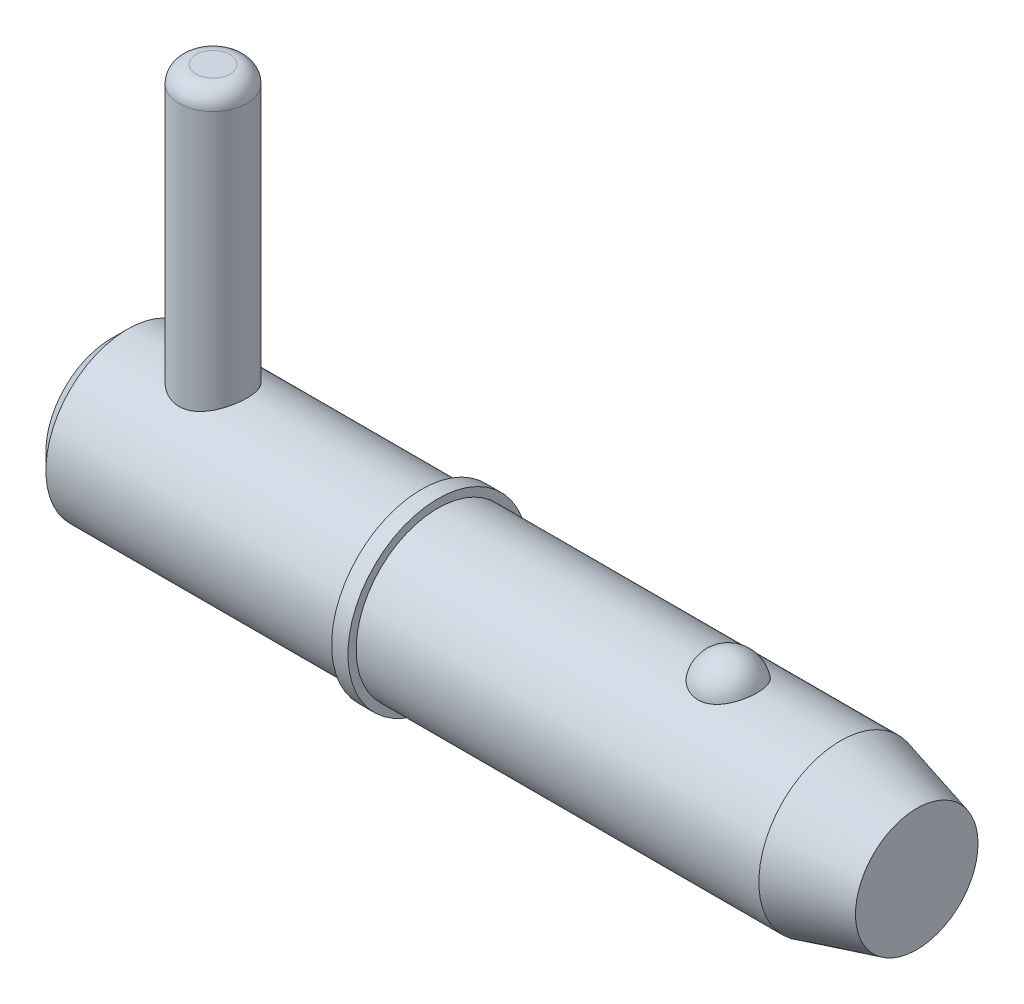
ISO-10303-21;
HEADER;
FILE_DESCRIPTION(('STEP AP214'),'2;1');
FILE_NAME('part.step','',(''),(''),'','','');
FILE_SCHEMA(('AUTOMOTIVE_DESIGN { 1 0 10303 214 1 1 1 1 }'));
ENDSEC;
DATA;
#1=APPLICATION_CONTEXT('core data for automotive mechanical design processes');
#2=APPLICATION_PROTOCOL_DEFINITION('international standard','automotive_design',2000,#1);
#3=PRODUCT_CONTEXT('',#1,'mechanical');
#4=PRODUCT('Part','Part','',(#3));
#5=PRODUCT_RELATED_PRODUCT_CATEGORY('part','',(#4));
#6=PRODUCT_DEFINITION_FORMATION('','',#4);
#7=PRODUCT_DEFINITION_CONTEXT('part definition',#1,'design');
#8=PRODUCT_DEFINITION('design','',#6,#7);
#9=PRODUCT_DEFINITION_SHAPE('','',#8);
#10=(LENGTH_UNIT() NAMED_UNIT(*) SI_UNIT(.MILLI.,.METRE.));
#11=(NAMED_UNIT(*) PLANE_ANGLE_UNIT() SI_UNIT($,.RADIAN.));
#12=(NAMED_UNIT(*) SI_UNIT($,.STERADIAN.) SOLID_ANGLE_UNIT());
#13=UNCERTAINTY_MEASURE_WITH_UNIT(LENGTH_MEASURE(1.E-05),#10,'distance_accuracy_value','');
#14=(GEOMETRIC_REPRESENTATION_CONTEXT(3) GLOBAL_UNCERTAINTY_ASSIGNED_CONTEXT((#13)) GLOBAL_UNIT_ASSIGNED_CONTEXT((#10,
#11,#12)) REPRESENTATION_CONTEXT('',''));
#15=CARTESIAN_POINT('',(0.,0.,0.));
#16=DIRECTION('',(0.,0.,1.));
#17=DIRECTION('',(1.,0.,0.));
#18=AXIS2_PLACEMENT_3D('',#15,#16,#17);
#19=CARTESIAN_POINT('',(5.94,20.635,0.));
#20=DIRECTION('',(0.,-1.,0.));
#21=DIRECTION('',(0.,0.,-1.));
#22=AXIS2_PLACEMENT_3D('',#19,#20,#21);
#23=CYLINDRICAL_SURFACE('',#22,1.98);
#24=CARTESIAN_POINT('',(5.94,-3.775,0.));
#25=DIRECTION('',(0.,1.,0.));
#26=DIRECTION('',(0.,0.,1.));
#27=AXIS2_PLACEMENT_3D('',#24,#25,#26);
#28=CIRCLE('',#27,1.98);
#29=CARTESIAN_POINT('',(5.94,-3.775,1.98));
#30=VERTEX_POINT('',#29);
#31=EDGE_CURVE('P0_E25',#30,#30,#28,.T.);
#32=ORIENTED_EDGE('',*,*,#31,.T.);
#33=EDGE_LOOP('',(#32));
#34=FACE_BOUND('',#33,.T.);
#35=CARTESIAN_POINT('',(5.94,19.645,0.));
#36=DIRECTION('',(0.,1.,0.));
#37=DIRECTION('',(0.,0.,1.));
#38=AXIS2_PLACEMENT_3D('',#35,#36,#37);
#39=CIRCLE('',#38,1.98);
#40=CARTESIAN_POINT('',(5.94,19.645,1.98));
#41=VERTEX_POINT('',#40);
#42=EDGE_CURVE('P0_E29',#41,#41,#39,.F.);
#43=ORIENTED_EDGE('',*,*,#42,.T.);
#44=EDGE_LOOP('',(#43));
#45=FACE_BOUND('',#44,.T.);
#46=ADVANCED_FACE('P0_F14',(#34,#45),#23,.T.);
#47=CARTESIAN_POINT('',(5.94,20.635,0.));
#48=DIRECTION('',(0.,1.,0.));
#49=DIRECTION('',(0.,0.,1.));
#50=AXIS2_PLACEMENT_3D('',#47,#48,#49);
#51=PLANE('',#50);
#52=CARTESIAN_POINT('',(5.94,20.635,0.));
#53=DIRECTION('',(0.,1.,0.));
#54=DIRECTION('',(0.,0.,1.));
#55=AXIS2_PLACEMENT_3D('',#52,#53,#54);
#56=CIRCLE('',#55,0.99);
#57=CARTESIAN_POINT('',(5.94,20.635,0.99));
#58=VERTEX_POINT('',#57);
#59=EDGE_CURVE('P0_E10',#58,#58,#56,.T.);
#60=ORIENTED_EDGE('',*,*,#59,.T.);
#61=EDGE_LOOP('',(#60));
#62=FACE_BOUND('',#61,.T.);
#63=ADVANCED_FACE('P0_F46',(#62),#51,.T.);
#64=CARTESIAN_POINT('',(5.94,-4.765,0.));
#65=DIRECTION('',(0.,1.,0.));
#66=DIRECTION('',(0.,0.,1.));
#67=AXIS2_PLACEMENT_3D('',#64,#65,#66);
#68=PLANE('',#67);
#69=CARTESIAN_POINT('',(5.94,-4.765,0.));
#70=DIRECTION('',(0.,1.,0.));
#71=DIRECTION('',(0.,0.,1.));
#72=AXIS2_PLACEMENT_3D('',#69,#70,#71);
#73=CIRCLE('',#72,0.99);
#74=CARTESIAN_POINT('',(5.94,-4.765,0.99));
#75=VERTEX_POINT('',#74);
#76=EDGE_CURVE('P0_E21',#75,#75,#73,.F.);
#77=ORIENTED_EDGE('',*,*,#76,.T.);
#78=EDGE_LOOP('',(#77));
#79=FACE_BOUND('',#78,.T.);
#80=ADVANCED_FACE('P0_F43',(#79),#68,.F.);
#81=CARTESIAN_POINT('',(5.94,-3.775,0.));
#82=DIRECTION('',(0.,1.,0.));
#83=DIRECTION('',(0.,0.,1.));
#84=AXIS2_PLACEMENT_3D('',#81,#82,#83);
#85=DEGENERATE_TOROIDAL_SURFACE('',#84,0.99,0.99,.T.);
#86=ORIENTED_EDGE('',*,*,#76,.F.);
#87=EDGE_LOOP('',(#86));
#88=FACE_BOUND('',#87,.T.);
#89=ORIENTED_EDGE('',*,*,#31,.F.);
#90=EDGE_LOOP('',(#89));
#91=FACE_BOUND('',#90,.T.);
#92=ADVANCED_FACE('P0_F38',(#88,#91),#85,.T.);
#93=CARTESIAN_POINT('',(5.94,19.645,0.));
#94=DIRECTION('',(0.,1.,0.));
#95=DIRECTION('',(0.,0.,1.));
#96=AXIS2_PLACEMENT_3D('',#93,#94,#95);
#97=DEGENERATE_TOROIDAL_SURFACE('',#96,0.99,0.99,.T.);
#98=ORIENTED_EDGE('',*,*,#42,.F.);
#99=EDGE_LOOP('',(#98));
#100=FACE_BOUND('',#99,.T.);
#101=ORIENTED_EDGE('',*,*,#59,.F.);
#102=EDGE_LOOP('',(#101));
#103=FACE_BOUND('',#102,.T.);
#104=ADVANCED_FACE('P0_F16',(#100,#103),#97,.T.);
#105=CLOSED_SHELL('',(#46,#63,#80,#92,#104));
#106=MANIFOLD_SOLID_BREP('P0_B1',#105);
#107=CARTESIAN_POINT('',(0.,0.,0.));
#108=DIRECTION('',(1.,0.,0.));
#109=DIRECTION('',(0.,0.,-1.));
#110=AXIS2_PLACEMENT_3D('',#107,#108,#109);
#111=CYLINDRICAL_SURFACE('',#110,4.765);
#112=CARTESIAN_POINT('',(42.5441944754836,0.,0.));
#113=DIRECTION('',(1.,0.,0.));
#114=DIRECTION('',(0.,0.,-1.));
#115=AXIS2_PLACEMENT_3D('',#112,#113,#114);
#116=CIRCLE('',#115,4.765);
#117=CARTESIAN_POINT('',(42.5441944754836,0.,-4.765));
#118=VERTEX_POINT('',#117);
#119=EDGE_CURVE('P1_E81',#118,#118,#116,.T.);
#120=ORIENTED_EDGE('',*,*,#119,.F.);
#121=EDGE_LOOP('',(#120));
#122=FACE_BOUND('',#121,.T.);
#123=CARTESIAN_POINT('',(19.05,0.,0.));
#124=DIRECTION('',(1.,0.,0.));
#125=DIRECTION('',(0.,0.,-1.));
#126=AXIS2_PLACEMENT_3D('',#123,#124,#125);
#127=CIRCLE('',#126,4.765);
#128=CARTESIAN_POINT('',(19.05,0.,-4.765));
#129=VERTEX_POINT('',#128);
#130=EDGE_CURVE('P1_E85',#129,#129,#127,.T.);
#131=ORIENTED_EDGE('',*,*,#130,.T.);
#132=EDGE_LOOP('',(#131));
#133=FACE_BOUND('',#132,.T.);
#134=CARTESIAN_POINT('',(35.991020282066,4.42764777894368,1.76101111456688));
#135=CARTESIAN_POINT('',(35.8997212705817,4.42764470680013,1.76101422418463));
#136=CARTESIAN_POINT('',(35.8084468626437,4.43059091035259,1.75366340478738));
#137=CARTESIAN_POINT('',(35.6286154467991,4.44201846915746,1.72451180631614));
#138=CARTESIAN_POINT('',(35.5400577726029,4.45049845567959,1.70271460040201));
#139=CARTESIAN_POINT('',(35.3682570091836,4.47200516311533,1.64539370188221));
#140=CARTESIAN_POINT('',(35.2850064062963,4.48502527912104,1.60988994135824));
#141=CARTESIAN_POINT('',(35.1257633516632,4.51419542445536,1.52617873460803));
#142=CARTESIAN_POINT('',(35.0497723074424,4.53034605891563,1.47796883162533));
#143=CARTESIAN_POINT('',(34.9047445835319,4.5645931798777,1.36860494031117));
#144=CARTESIAN_POINT('',(34.8359645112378,4.58273170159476,1.3071242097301));
#145=CARTESIAN_POINT('',(34.7093423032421,4.61870302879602,1.17370204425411));
#146=CARTESIAN_POINT('',(34.6515021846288,4.63653577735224,1.10175868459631));
#147=CARTESIAN_POINT('',(34.5455709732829,4.67090140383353,0.945806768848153));
#148=CARTESIAN_POINT('',(34.4980305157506,4.68734068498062,0.861402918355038));
#149=CARTESIAN_POINT('',(34.4170817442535,4.71628466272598,0.685442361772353));
#150=CARTESIAN_POINT('',(34.3836747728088,4.72878898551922,0.593884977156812));
#151=CARTESIAN_POINT('',(34.331287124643,4.74874061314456,0.404781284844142));
#152=CARTESIAN_POINT('',(34.3125178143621,4.75611366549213,0.307168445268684));
#153=CARTESIAN_POINT('',(34.2905846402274,4.76475393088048,0.109940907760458));
#154=CARTESIAN_POINT('',(34.2874205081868,4.76602124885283,0.0103262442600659));
#155=CARTESIAN_POINT('',(34.2967405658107,4.76232928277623,-0.187629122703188));
#156=CARTESIAN_POINT('',(34.3091588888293,4.7573962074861,-0.285973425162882));
#157=CARTESIAN_POINT('',(34.3492804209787,4.74184975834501,-0.479027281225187));
#158=CARTESIAN_POINT('',(34.3769839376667,4.7312362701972,-0.573736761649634));
#159=CARTESIAN_POINT('',(34.4471581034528,4.70540026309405,-0.756973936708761));
#160=CARTESIAN_POINT('',(34.4896460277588,4.69017235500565,-0.845494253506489));
#161=CARTESIAN_POINT('',(34.588520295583,4.6566986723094,-1.01378033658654));
#162=CARTESIAN_POINT('',(34.6449076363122,4.63845268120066,-1.09354547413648));
#163=CARTESIAN_POINT('',(34.770552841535,4.60085438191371,-1.24228523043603));
#164=CARTESIAN_POINT('',(34.8398439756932,4.58149930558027,-1.31123108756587));
#165=CARTESIAN_POINT('',(34.9896066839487,4.54391653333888,-1.43607409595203));
#166=CARTESIAN_POINT('',(35.0700771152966,4.52568872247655,-1.49197257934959));
#167=CARTESIAN_POINT('',(35.2381500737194,4.49293007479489,-1.58786764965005));
#168=CARTESIAN_POINT('',(35.3255445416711,4.47832346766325,-1.62820219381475));
#169=CARTESIAN_POINT('',(35.506553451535,4.45406011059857,-1.69345757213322));
#170=CARTESIAN_POINT('',(35.6001655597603,4.44440151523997,-1.71838415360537));
#171=CARTESIAN_POINT('',(35.7858939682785,4.43159888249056,-1.75112843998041));
#172=CARTESIAN_POINT('',(35.877849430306,4.42815213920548,-1.75974223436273));
#173=CARTESIAN_POINT('',(36.0619658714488,4.427247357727,-1.76201865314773));
#174=CARTESIAN_POINT('',(36.1541268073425,4.42978816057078,-1.7556841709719));
#175=CARTESIAN_POINT('',(36.3331292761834,4.4403864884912,-1.72869560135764));
#176=CARTESIAN_POINT('',(36.4200474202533,4.44827555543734,-1.70847853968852));
#177=CARTESIAN_POINT('',(36.5891314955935,4.46852246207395,-1.65479562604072));
#178=CARTESIAN_POINT('',(36.6712970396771,4.48088066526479,-1.62132869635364));
#179=CARTESIAN_POINT('',(36.8305916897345,4.50907357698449,-1.54120560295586));
#180=CARTESIAN_POINT('',(36.9075700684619,4.52497884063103,-1.49427526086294));
#181=CARTESIAN_POINT('',(37.0527080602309,4.55845148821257,-1.38881222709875));
#182=CARTESIAN_POINT('',(37.1208656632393,4.57601924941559,-1.33027689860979));
#183=CARTESIAN_POINT('',(37.2500990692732,4.61196537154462,-1.19991049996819));
#184=CARTESIAN_POINT('',(37.3106562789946,4.63034074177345,-1.12756415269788));
#185=CARTESIAN_POINT('',(37.4192797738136,4.66513959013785,-0.973612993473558));
#186=CARTESIAN_POINT('',(37.4673438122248,4.68156271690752,-0.892006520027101));
#187=CARTESIAN_POINT('',(37.551383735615,4.71130224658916,-0.718892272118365));
#188=CARTESIAN_POINT('',(37.5869185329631,4.724501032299,-0.627149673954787));
#189=CARTESIAN_POINT('',(37.6429522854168,4.74571823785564,-0.438611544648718));
#190=CARTESIAN_POINT('',(37.663450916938,4.75373654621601,-0.341815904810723));
#191=CARTESIAN_POINT('',(37.6890338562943,4.76378905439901,-0.145633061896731));
#192=CARTESIAN_POINT('',(37.694076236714,4.76580697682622,-0.0462395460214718));
#193=CARTESIAN_POINT('',(37.6885239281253,4.76360573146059,0.15203857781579));
#194=CARTESIAN_POINT('',(37.6779294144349,4.75938663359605,0.250923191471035));
#195=CARTESIAN_POINT('',(37.6413875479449,4.74516937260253,0.445004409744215));
#196=CARTESIAN_POINT('',(37.6154964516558,4.73519238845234,0.54021317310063));
#197=CARTESIAN_POINT('',(37.5489273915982,4.7104939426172,0.724662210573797));
#198=CARTESIAN_POINT('',(37.508248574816,4.69577220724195,0.813902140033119));
#199=CARTESIAN_POINT('',(37.4127177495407,4.66303767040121,0.984313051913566));
#200=CARTESIAN_POINT('',(37.3578042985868,4.64501070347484,1.06544688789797));
#201=CARTESIAN_POINT('',(37.2350496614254,4.60764678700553,1.21692673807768));
#202=CARTESIAN_POINT('',(37.1672086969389,4.58830985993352,1.2872729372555));
#203=CARTESIAN_POINT('',(37.0205480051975,4.55060370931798,1.41479271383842));
#204=CARTESIAN_POINT('',(36.9417918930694,4.53222967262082,1.47203785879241));
#205=CARTESIAN_POINT('',(36.7749890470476,4.49849576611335,1.57212016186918));
#206=CARTESIAN_POINT('',(36.6869417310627,4.48313608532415,1.61495641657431));
#207=CARTESIAN_POINT('',(36.4997918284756,4.45676184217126,1.68642657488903));
#208=CARTESIAN_POINT('',(36.4003653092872,4.44598302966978,1.71430590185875));
#209=CARTESIAN_POINT('',(36.1976210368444,4.43142918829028,1.7515925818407));
#210=CARTESIAN_POINT('',(36.0943049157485,4.42765125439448,1.76100759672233));
#211=CARTESIAN_POINT('',(35.991020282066,4.42764777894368,1.76101111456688));
#212=B_SPLINE_CURVE_WITH_KNOTS('',3,(#134,#135,#136,#137,#138,#139,#140,#141,#142,#143,#144,
#145,#146,#147,#148,#149,#150,#151,#152,#153,#154,#155,#156,#157,#158,#159,#160,#161,#162,#163,
#164,#165,#166,#167,#168,#169,#170,#171,#172,#173,#174,#175,#176,#177,#178,#179,#180,#181,#182,
#183,#184,#185,#186,#187,#188,#189,#190,#191,#192,#193,#194,#195,#196,#197,#198,#199,#200,#201,
#202,#203,#204,#205,#206,#207,#208,#209,#210,#211),.UNSPECIFIED.,.T.,.F.,(4,2,2,2,2,2,2,2,2,2,2,
2,2,2,2,2,2,2,2,2,2,2,2,2,2,2,2,2,2,2,2,2,2,2,2,2,2,2,4),(0.,0.273517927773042,
0.546968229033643,0.820022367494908,1.09312934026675,1.37393946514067,1.65480131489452,
1.94820420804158,2.24163496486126,2.53922817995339,2.8368162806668,3.13315071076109,
3.42949110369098,3.72617893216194,4.02288805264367,4.32037303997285,4.61782764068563,
4.90840095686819,5.19886582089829,5.4747485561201,5.75057789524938,6.01809977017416,
6.28564340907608,6.55907787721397,6.83257454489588,7.11962987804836,7.40673679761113,
7.70312663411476,7.99952284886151,8.29672237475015,8.59391856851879,8.89002850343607,
9.18615552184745,9.483582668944,9.78100471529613,10.0767610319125,10.3725358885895,
10.6820893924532,10.991514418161),.UNSPECIFIED.);
#213=CARTESIAN_POINT('',(35.991020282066,4.42764777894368,1.76101111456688));
#214=VERTEX_POINT('',#213);
#215=EDGE_CURVE('P1_E35',#214,#214,#212,.T.);
#216=ORIENTED_EDGE('',*,*,#215,.T.);
#217=EDGE_LOOP('',(#216));
#218=FACE_BOUND('',#217,.T.);
#219=ADVANCED_FACE('P1_F13',(#122,#133,#218),#111,.T.);
#220=CARTESIAN_POINT('',(0.,0.,0.));
#221=DIRECTION('',(-1.,0.,0.));
#222=DIRECTION('',(0.,0.,1.));
#223=AXIS2_PLACEMENT_3D('',#220,#221,#222);
#224=PLANE('',#223);
#225=CARTESIAN_POINT('',(0.,0.,0.));
#226=DIRECTION('',(1.,0.,0.));
#227=DIRECTION('',(0.,0.,-1.));
#228=AXIS2_PLACEMENT_3D('',#225,#226,#227);
#229=CIRCLE('',#228,3.812);
#230=CARTESIAN_POINT('',(0.,0.,-3.812));
#231=VERTEX_POINT('',#230);
#232=EDGE_CURVE('P1_E9',#231,#231,#229,.T.);
#233=ORIENTED_EDGE('',*,*,#232,.F.);
#234=EDGE_LOOP('',(#233));
#235=FACE_BOUND('',#234,.T.);
#236=ADVANCED_FACE('P1_F15',(#235),#224,.T.);
#237=CARTESIAN_POINT('',(0.952999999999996,0.,0.));
#238=DIRECTION('',(1.,0.,0.));
#239=DIRECTION('',(0.,0.,-1.));
#240=AXIS2_PLACEMENT_3D('',#237,#238,#239);
#241=CONICAL_SURFACE('',#240,4.765,0.78539816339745);
#242=ORIENTED_EDGE('',*,*,#232,.T.);
#243=EDGE_LOOP('',(#242));
#244=FACE_BOUND('',#243,.T.);
#245=CARTESIAN_POINT('',(0.952999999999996,0.,0.));
#246=DIRECTION('',(1.,0.,0.));
#247=DIRECTION('',(0.,0.,-1.));
#248=AXIS2_PLACEMENT_3D('',#245,#246,#247);
#249=CIRCLE('',#248,4.765);
#250=CARTESIAN_POINT('',(0.952999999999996,0.,-4.765));
#251=VERTEX_POINT('',#250);
#252=EDGE_CURVE('P1_E26',#251,#251,#249,.T.);
#253=ORIENTED_EDGE('',*,*,#252,.F.);
#254=EDGE_LOOP('',(#253));
#255=FACE_BOUND('',#254,.T.);
#256=ADVANCED_FACE('P1_F77',(#244,#255),#241,.T.);
#257=CARTESIAN_POINT('',(0.,0.,0.));
#258=DIRECTION('',(1.,0.,0.));
#259=DIRECTION('',(0.,0.,-1.));
#260=AXIS2_PLACEMENT_3D('',#257,#258,#259);
#261=CYLINDRICAL_SURFACE('',#260,4.765);
#262=CARTESIAN_POINT('',(5.94,-4.33414639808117,1.98));
#263=CARTESIAN_POINT('',(5.83435484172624,-4.33415447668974,1.97999169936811));
#264=CARTESIAN_POINT('',(5.72854887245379,-4.33806396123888,1.97149330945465));
#265=CARTESIAN_POINT('',(5.51998191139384,-4.35319906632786,1.93783487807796));
#266=CARTESIAN_POINT('',(5.41723000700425,-4.3644446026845,1.91262947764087));
#267=CARTESIAN_POINT('',(5.21817294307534,-4.39274225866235,1.84670269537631));
#268=CARTESIAN_POINT('',(5.12184344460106,-4.40977076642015,1.80604432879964));
#269=CARTESIAN_POINT('',(4.93740039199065,-4.44768106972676,1.71055160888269));
#270=CARTESIAN_POINT('',(4.84928487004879,-4.46856193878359,1.65572066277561));
#271=CARTESIAN_POINT('',(4.67826533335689,-4.51326966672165,1.52981120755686));
#272=CARTESIAN_POINT('',(4.59593118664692,-4.53719608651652,1.45799365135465));
#273=CARTESIAN_POINT('',(4.44405452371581,-4.58448035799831,1.30170177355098));
#274=CARTESIAN_POINT('',(4.37451692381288,-4.60783798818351,1.21722260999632));
#275=CARTESIAN_POINT('',(4.24730683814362,-4.65256187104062,1.03353484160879));
#276=CARTESIAN_POINT('',(4.19027484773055,-4.67379892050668,0.933848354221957));
#277=CARTESIAN_POINT('',(4.0940363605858,-4.7106711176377,0.7252544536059));
#278=CARTESIAN_POINT('',(4.05482199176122,-4.72630873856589,0.61635113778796));
#279=CARTESIAN_POINT('',(3.99739515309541,-4.74951416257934,0.398397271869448));
#280=CARTESIAN_POINT('',(3.97820018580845,-4.7574579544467,0.289646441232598));
#281=CARTESIAN_POINT('',(3.95818309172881,-4.76574596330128,0.0701967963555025));
#282=CARTESIAN_POINT('',(3.95735355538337,-4.76609324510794,-0.0405012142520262));
#283=CARTESIAN_POINT('',(3.9735743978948,-4.75937098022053,-0.253561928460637));
#284=CARTESIAN_POINT('',(3.98954548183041,-4.75274912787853,-0.356023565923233));
#285=CARTESIAN_POINT('',(4.03706504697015,-4.73344665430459,-0.556659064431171));
#286=CARTESIAN_POINT('',(4.06861467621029,-4.72076558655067,-0.654832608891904));
#287=CARTESIAN_POINT('',(4.14677192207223,-4.69032846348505,-0.845904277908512));
#288=CARTESIAN_POINT('',(4.19360181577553,-4.67249797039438,-0.938699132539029));
#289=CARTESIAN_POINT('',(4.30077315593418,-4.63350852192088,-1.11535616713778));
#290=CARTESIAN_POINT('',(4.3611193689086,-4.61234839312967,-1.19921518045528));
#291=CARTESIAN_POINT('',(4.49853487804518,-4.56707259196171,-1.3618711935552));
#292=CARTESIAN_POINT('',(4.57648039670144,-4.5428537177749,-1.43990029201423));
#293=CARTESIAN_POINT('',(4.74440779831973,-4.49530722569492,-1.58211009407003));
#294=CARTESIAN_POINT('',(4.83439425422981,-4.47197995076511,-1.64628551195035));
#295=CARTESIAN_POINT('',(5.02755026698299,-4.42812342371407,-1.76092221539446));
#296=CARTESIAN_POINT('',(5.13105348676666,-4.40770990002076,-1.81086937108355));
#297=CARTESIAN_POINT('',(5.34607555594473,-4.37336901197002,-1.89231211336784));
#298=CARTESIAN_POINT('',(5.45758864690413,-4.3594370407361,-1.92382080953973));
#299=CARTESIAN_POINT('',(5.67777275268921,-4.34077746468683,-1.96554536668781));
#300=CARTESIAN_POINT('',(5.78616167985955,-4.33551319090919,-1.9770057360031));
#301=CARTESIAN_POINT('',(6.00341835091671,-4.33325118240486,-1.98196183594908));
#302=CARTESIAN_POINT('',(6.11228591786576,-4.33625061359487,-1.97546372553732));
#303=CARTESIAN_POINT('',(6.32012423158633,-4.34962383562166,-1.94582288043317));
#304=CARTESIAN_POINT('',(6.41928436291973,-4.35951709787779,-1.92376364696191));
#305=CARTESIAN_POINT('',(6.61241543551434,-4.38495043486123,-1.86506038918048));
#306=CARTESIAN_POINT('',(6.70638516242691,-4.40049182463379,-1.82841296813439));
#307=CARTESIAN_POINT('',(6.89090272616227,-4.43627016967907,-1.73985559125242));
#308=CARTESIAN_POINT('',(6.98113841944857,-4.45667771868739,-1.68736639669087));
#309=CARTESIAN_POINT('',(7.1519532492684,-4.49964530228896,-1.56919282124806));
#310=CARTESIAN_POINT('',(7.232528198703,-4.52220626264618,-1.50350275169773));
#311=CARTESIAN_POINT('',(7.38851617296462,-4.56914071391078,-1.35452895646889));
#312=CARTESIAN_POINT('',(7.46298462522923,-4.5935132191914,-1.27025197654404));
#313=CARTESIAN_POINT('',(7.59689029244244,-4.63962841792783,-1.08983181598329));
#314=CARTESIAN_POINT('',(7.65632644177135,-4.66137092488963,-0.993687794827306));
#315=CARTESIAN_POINT('',(7.75840361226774,-4.69991192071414,-0.791608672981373));
#316=CARTESIAN_POINT('',(7.80100481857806,-4.71669866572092,-0.685651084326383));
#317=CARTESIAN_POINT('',(7.86746997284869,-4.74331408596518,-0.467197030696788));
#318=CARTESIAN_POINT('',(7.8913450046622,-4.75314687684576,-0.354704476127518));
#319=CARTESIAN_POINT('',(7.91828971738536,-4.76427543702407,-0.134819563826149));
#320=CARTESIAN_POINT('',(7.92269147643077,-4.76611762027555,-0.027616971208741));
#321=CARTESIAN_POINT('',(7.91414154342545,-4.76256684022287,0.185959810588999));
#322=CARTESIAN_POINT('',(7.90119286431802,-4.75717513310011,0.292334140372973));
#323=CARTESIAN_POINT('',(7.85926572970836,-4.74004856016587,0.497383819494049));
#324=CARTESIAN_POINT('',(7.83086647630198,-4.72854322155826,0.596198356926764));
#325=CARTESIAN_POINT('',(7.75947503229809,-4.70045111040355,0.787624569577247));
#326=CARTESIAN_POINT('',(7.71648006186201,-4.68386336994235,0.880235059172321));
#327=CARTESIAN_POINT('',(7.6149456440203,-4.64628321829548,1.06122875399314));
#328=CARTESIAN_POINT('',(7.55579211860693,-4.62512577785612,1.14923242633));
#329=CARTESIAN_POINT('',(7.42451813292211,-4.58091700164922,1.31443888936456));
#330=CARTESIAN_POINT('',(7.35239289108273,-4.5578649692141,1.39163767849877));
#331=CARTESIAN_POINT('',(7.19146107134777,-4.51050832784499,1.53847013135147));
#332=CARTESIAN_POINT('',(7.10185635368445,-4.48622440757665,1.60723941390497));
#333=CARTESIAN_POINT('',(6.91164948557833,-4.44076541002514,1.72888900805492));
#334=CARTESIAN_POINT('',(6.81104124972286,-4.41959206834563,1.78176046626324));
#335=CARTESIAN_POINT('',(6.60181953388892,-4.38318936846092,1.86953227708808));
#336=CARTESIAN_POINT('',(6.49325511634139,-4.3679267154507,1.90453365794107));
#337=CARTESIAN_POINT('',(6.32681512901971,-4.35102038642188,1.94268459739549));
#338=CARTESIAN_POINT('',(6.27079191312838,-4.34638447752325,1.953006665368));
#339=CARTESIAN_POINT('',(6.15793999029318,-4.33925923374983,1.96879053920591));
#340=CARTESIAN_POINT('',(6.10111188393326,-4.33676837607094,1.97425579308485));
#341=CARTESIAN_POINT('',(6.00947316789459,-4.33456308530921,1.97908711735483));
#342=CARTESIAN_POINT('',(5.97474528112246,-4.33414374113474,1.98000272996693));
#343=CARTESIAN_POINT('',(5.94,-4.33414639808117,1.98));
#344=B_SPLINE_CURVE_WITH_KNOTS('',3,(#262,#263,#264,#265,#266,#267,#268,#269,#270,#271,#272,
#273,#274,#275,#276,#277,#278,#279,#280,#281,#282,#283,#284,#285,#286,#287,#288,#289,#290,#291,
#292,#293,#294,#295,#296,#297,#298,#299,#300,#301,#302,#303,#304,#305,#306,#307,#308,#309,#310,
#311,#312,#313,#314,#315,#316,#317,#318,#319,#320,#321,#322,#323,#324,#325,#326,#327,#328,#329,
#330,#331,#332,#333,#334,#335,#336,#337,#338,#339,#340,#341,#342,#343),.UNSPECIFIED.,.T.,.F.,(4,
2,2,2,2,2,2,2,2,2,2,2,2,2,2,2,2,2,2,2,2,2,2,2,2,2,2,2,2,2,2,2,2,2,2,2,2,2,2,2,4),(0.,
0.316814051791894,0.634491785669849,0.950887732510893,1.2672076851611,1.60127705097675,
1.93547449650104,2.28407463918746,2.63252061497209,2.96292077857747,3.29318763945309,
3.60346227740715,3.91375978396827,4.22878888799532,4.54392926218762,4.88117914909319,
5.21855748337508,5.56691259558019,5.91501972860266,6.24062939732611,6.56612741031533,
6.87094948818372,7.17584258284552,7.49361276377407,7.81152017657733,8.15513975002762,
8.4987836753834,8.8432355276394,9.18748334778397,9.50777781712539,9.8280166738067,
10.1370037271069,10.4460496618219,10.7690461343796,11.0921619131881,11.4371238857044,
11.7822776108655,12.1254577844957,12.2967183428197,12.4678572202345,12.5720531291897),.UNSPECIFIED.);
#345=CARTESIAN_POINT('',(5.94,-4.33414639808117,1.98));
#346=VERTEX_POINT('',#345);
#347=EDGE_CURVE('P1_E17',#346,#346,#344,.T.);
#348=ORIENTED_EDGE('',*,*,#347,.F.);
#349=EDGE_LOOP('',(#348));
#350=FACE_BOUND('',#349,.T.);
#351=CARTESIAN_POINT('',(5.94,4.33414639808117,1.98));
#352=CARTESIAN_POINT('',(6.04564515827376,4.33415447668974,1.97999169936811));
#353=CARTESIAN_POINT('',(6.15145112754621,4.33806396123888,1.97149330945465));
#354=CARTESIAN_POINT('',(6.36001808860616,4.35319906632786,1.93783487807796));
#355=CARTESIAN_POINT('',(6.46276999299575,4.3644446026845,1.91262947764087));
#356=CARTESIAN_POINT('',(6.66182705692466,4.39274225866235,1.84670269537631));
#357=CARTESIAN_POINT('',(6.75815655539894,4.40977076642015,1.80604432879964));
#358=CARTESIAN_POINT('',(6.94259960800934,4.44768106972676,1.71055160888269));
#359=CARTESIAN_POINT('',(7.03071512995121,4.46856193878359,1.65572066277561));
#360=CARTESIAN_POINT('',(7.20173466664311,4.51326966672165,1.52981120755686));
#361=CARTESIAN_POINT('',(7.28406881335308,4.53719608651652,1.45799365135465));
#362=CARTESIAN_POINT('',(7.43594547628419,4.58448035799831,1.30170177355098));
#363=CARTESIAN_POINT('',(7.50548307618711,4.60783798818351,1.21722260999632));
#364=CARTESIAN_POINT('',(7.63269316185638,4.65256187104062,1.03353484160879));
#365=CARTESIAN_POINT('',(7.68972515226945,4.67379892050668,0.933848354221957));
#366=CARTESIAN_POINT('',(7.7859636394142,4.7106711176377,0.7252544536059));
#367=CARTESIAN_POINT('',(7.82517800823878,4.72630873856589,0.61635113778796));
#368=CARTESIAN_POINT('',(7.88260484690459,4.74951416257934,0.398397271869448));
#369=CARTESIAN_POINT('',(7.90179981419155,4.7574579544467,0.289646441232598));
#370=CARTESIAN_POINT('',(7.92181690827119,4.76574596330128,0.0701967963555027));
#371=CARTESIAN_POINT('',(7.92264644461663,4.76609324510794,-0.040501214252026));
#372=CARTESIAN_POINT('',(7.9064256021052,4.75937098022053,-0.253561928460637));
#373=CARTESIAN_POINT('',(7.89045451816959,4.75274912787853,-0.356023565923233));
#374=CARTESIAN_POINT('',(7.84293495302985,4.73344665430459,-0.55665906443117));
#375=CARTESIAN_POINT('',(7.81138532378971,4.72076558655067,-0.654832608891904));
#376=CARTESIAN_POINT('',(7.73322807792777,4.69032846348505,-0.845904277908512));
#377=CARTESIAN_POINT('',(7.68639818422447,4.67249797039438,-0.938699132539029));
#378=CARTESIAN_POINT('',(7.57922684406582,4.63350852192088,-1.11535616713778));
#379=CARTESIAN_POINT('',(7.5188806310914,4.61234839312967,-1.19921518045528));
#380=CARTESIAN_POINT('',(7.38146512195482,4.56707259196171,-1.3618711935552));
#381=CARTESIAN_POINT('',(7.30351960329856,4.5428537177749,-1.43990029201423));
#382=CARTESIAN_POINT('',(7.13559220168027,4.49530722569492,-1.58211009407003));
#383=CARTESIAN_POINT('',(7.04560574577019,4.47197995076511,-1.64628551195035));
#384=CARTESIAN_POINT('',(6.85244973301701,4.42812342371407,-1.76092221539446));
#385=CARTESIAN_POINT('',(6.74894651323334,4.40770990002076,-1.81086937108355));
#386=CARTESIAN_POINT('',(6.53392444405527,4.37336901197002,-1.89231211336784));
#387=CARTESIAN_POINT('',(6.42241135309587,4.3594370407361,-1.92382080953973));
#388=CARTESIAN_POINT('',(6.20222724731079,4.34077746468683,-1.96554536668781));
#389=CARTESIAN_POINT('',(6.09383832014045,4.33551319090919,-1.9770057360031));
#390=CARTESIAN_POINT('',(5.87658164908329,4.33325118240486,-1.98196183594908));
#391=CARTESIAN_POINT('',(5.76771408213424,4.33625061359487,-1.97546372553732));
#392=CARTESIAN_POINT('',(5.55987576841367,4.34962383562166,-1.94582288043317));
#393=CARTESIAN_POINT('',(5.46071563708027,4.35951709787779,-1.92376364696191));
#394=CARTESIAN_POINT('',(5.26758456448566,4.38495043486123,-1.86506038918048));
#395=CARTESIAN_POINT('',(5.17361483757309,4.40049182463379,-1.82841296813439));
#396=CARTESIAN_POINT('',(4.98909727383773,4.43627016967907,-1.73985559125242));
#397=CARTESIAN_POINT('',(4.89886158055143,4.45667771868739,-1.68736639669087));
#398=CARTESIAN_POINT('',(4.72804675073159,4.49964530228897,-1.56919282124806));
#399=CARTESIAN_POINT('',(4.647471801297,4.52220626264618,-1.50350275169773));
#400=CARTESIAN_POINT('',(4.49148382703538,4.56914071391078,-1.35452895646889));
#401=CARTESIAN_POINT('',(4.41701537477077,4.5935132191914,-1.27025197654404));
#402=CARTESIAN_POINT('',(4.28310970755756,4.63962841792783,-1.08983181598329));
#403=CARTESIAN_POINT('',(4.22367355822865,4.66137092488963,-0.993687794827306));
#404=CARTESIAN_POINT('',(4.12159638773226,4.69991192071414,-0.791608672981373));
#405=CARTESIAN_POINT('',(4.07899518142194,4.71669866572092,-0.685651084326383));
#406=CARTESIAN_POINT('',(4.01253002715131,4.74331408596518,-0.467197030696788));
#407=CARTESIAN_POINT('',(3.98865499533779,4.75314687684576,-0.354704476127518));
#408=CARTESIAN_POINT('',(3.96171028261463,4.76427543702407,-0.134819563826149));
#409=CARTESIAN_POINT('',(3.95730852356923,4.76611762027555,-0.0276169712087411));
#410=CARTESIAN_POINT('',(3.96585845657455,4.76256684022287,0.185959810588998));
#411=CARTESIAN_POINT('',(3.97880713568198,4.75717513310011,0.292334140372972));
#412=CARTESIAN_POINT('',(4.02073427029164,4.74004856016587,0.497383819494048));
#413=CARTESIAN_POINT('',(4.04913352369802,4.72854322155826,0.596198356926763));
#414=CARTESIAN_POINT('',(4.12052496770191,4.70045111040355,0.787624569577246));
#415=CARTESIAN_POINT('',(4.16351993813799,4.68386336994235,0.880235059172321));
#416=CARTESIAN_POINT('',(4.2650543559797,4.64628321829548,1.06122875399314));
#417=CARTESIAN_POINT('',(4.32420788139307,4.62512577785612,1.14923242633));
#418=CARTESIAN_POINT('',(4.45548186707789,4.58091700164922,1.31443888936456));
#419=CARTESIAN_POINT('',(4.52760710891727,4.5578649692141,1.39163767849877));
#420=CARTESIAN_POINT('',(4.68853892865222,4.51050832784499,1.53847013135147));
#421=CARTESIAN_POINT('',(4.77814364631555,4.48622440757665,1.60723941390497));
#422=CARTESIAN_POINT('',(4.96835051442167,4.44076541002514,1.72888900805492));
#423=CARTESIAN_POINT('',(5.06895875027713,4.41959206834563,1.78176046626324));
#424=CARTESIAN_POINT('',(5.27818046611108,4.38318936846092,1.86953227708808));
#425=CARTESIAN_POINT('',(5.38674488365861,4.3679267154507,1.90453365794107));
#426=CARTESIAN_POINT('',(5.55318487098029,4.35102038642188,1.94268459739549));
#427=CARTESIAN_POINT('',(5.60920808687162,4.34638447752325,1.953006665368));
#428=CARTESIAN_POINT('',(5.72206000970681,4.33925923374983,1.96879053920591));
#429=CARTESIAN_POINT('',(5.77888811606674,4.33676837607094,1.97425579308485));
#430=CARTESIAN_POINT('',(5.87052683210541,4.33456308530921,1.97908711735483));
#431=CARTESIAN_POINT('',(5.90525471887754,4.33414374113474,1.98000272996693));
#432=CARTESIAN_POINT('',(5.94,4.33414639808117,1.98));
#433=B_SPLINE_CURVE_WITH_KNOTS('',3,(#351,#352,#353,#354,#355,#356,#357,#358,#359,#360,#361,
#362,#363,#364,#365,#366,#367,#368,#369,#370,#371,#372,#373,#374,#375,#376,#377,#378,#379,#380,
#381,#382,#383,#384,#385,#386,#387,#388,#389,#390,#391,#392,#393,#394,#395,#396,#397,#398,#399,
#400,#401,#402,#403,#404,#405,#406,#407,#408,#409,#410,#411,#412,#413,#414,#415,#416,#417,#418,
#419,#420,#421,#422,#423,#424,#425,#426,#427,#428,#429,#430,#431,#432),.UNSPECIFIED.,.T.,.F.,(4,
2,2,2,2,2,2,2,2,2,2,2,2,2,2,2,2,2,2,2,2,2,2,2,2,2,2,2,2,2,2,2,2,2,2,2,2,2,2,2,4),(0.,
0.316814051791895,0.634491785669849,0.950887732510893,1.2672076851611,1.60127705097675,
1.93547449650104,2.28407463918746,2.63252061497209,2.96292077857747,3.29318763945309,
3.60346227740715,3.91375978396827,4.22878888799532,4.54392926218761,4.88117914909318,
5.21855748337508,5.56691259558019,5.91501972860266,6.24062939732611,6.56612741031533,
6.87094948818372,7.17584258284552,7.49361276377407,7.81152017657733,8.15513975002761,
8.4987836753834,8.84323552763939,9.18748334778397,9.50777781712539,9.8280166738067,
10.1370037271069,10.4460496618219,10.7690461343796,11.0921619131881,11.4371238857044,
11.7822776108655,12.1254577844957,12.2967183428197,12.4678572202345,12.5720531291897),.UNSPECIFIED.);
#434=CARTESIAN_POINT('',(5.94,4.33414639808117,1.98));
#435=VERTEX_POINT('',#434);
#436=EDGE_CURVE('P1_E43',#435,#435,#433,.T.);
#437=ORIENTED_EDGE('',*,*,#436,.F.);
#438=EDGE_LOOP('',(#437));
#439=FACE_BOUND('',#438,.T.);
#440=ORIENTED_EDGE('',*,*,#252,.T.);
#441=EDGE_LOOP('',(#440));
#442=FACE_BOUND('',#441,.T.);
#443=CARTESIAN_POINT('',(18.097,0.,0.));
#444=DIRECTION('',(1.,0.,0.));
#445=DIRECTION('',(0.,0.,-1.));
#446=AXIS2_PLACEMENT_3D('',#443,#444,#445);
#447=CIRCLE('',#446,4.765);
#448=CARTESIAN_POINT('',(18.097,0.,-4.765));
#449=VERTEX_POINT('',#448);
#450=EDGE_CURVE('P1_E31',#449,#449,#447,.T.);
#451=ORIENTED_EDGE('',*,*,#450,.F.);
#452=EDGE_LOOP('',(#451));
#453=FACE_BOUND('',#452,.T.);
#454=ADVANCED_FACE('P1_F103',(#350,#439,#442,#453),#261,.T.);
#455=CARTESIAN_POINT('',(18.097,4.765,0.));
#456=DIRECTION('',(-1.,0.,0.));
#457=DIRECTION('',(0.,0.,1.));
#458=AXIS2_PLACEMENT_3D('',#455,#456,#457);
#459=PLANE('',#458);
#460=ORIENTED_EDGE('',*,*,#450,.T.);
#461=EDGE_LOOP('',(#460));
#462=FACE_BOUND('',#461,.T.);
#463=CARTESIAN_POINT('',(18.097,0.,0.));
#464=DIRECTION('',(1.,0.,0.));
#465=DIRECTION('',(0.,0.,-1.));
#466=AXIS2_PLACEMENT_3D('',#463,#464,#465);
#467=CIRCLE('',#466,5.2415);
#468=CARTESIAN_POINT('',(18.097,0.,-5.2415));
#469=VERTEX_POINT('',#468);
#470=EDGE_CURVE('P1_E91',#469,#469,#467,.T.);
#471=ORIENTED_EDGE('',*,*,#470,.F.);
#472=EDGE_LOOP('',(#471));
#473=FACE_BOUND('',#472,.T.);
#474=ADVANCED_FACE('P1_F100',(#462,#473),#459,.T.);
#475=CARTESIAN_POINT('',(0.,0.,0.));
#476=DIRECTION('',(1.,0.,0.));
#477=DIRECTION('',(0.,0.,-1.));
#478=AXIS2_PLACEMENT_3D('',#475,#476,#477);
#479=CYLINDRICAL_SURFACE('',#478,5.2415);
#480=ORIENTED_EDGE('',*,*,#470,.T.);
#481=EDGE_LOOP('',(#480));
#482=FACE_BOUND('',#481,.T.);
#483=CARTESIAN_POINT('',(19.05,0.,0.));
#484=DIRECTION('',(1.,0.,0.));
#485=DIRECTION('',(0.,0.,-1.));
#486=AXIS2_PLACEMENT_3D('',#483,#484,#485);
#487=CIRCLE('',#486,5.2415);
#488=CARTESIAN_POINT('',(19.05,0.,-5.2415));
#489=VERTEX_POINT('',#488);
#490=EDGE_CURVE('P1_E88',#489,#489,#487,.T.);
#491=ORIENTED_EDGE('',*,*,#490,.F.);
#492=EDGE_LOOP('',(#491));
#493=FACE_BOUND('',#492,.T.);
#494=ADVANCED_FACE('P1_F68',(#482,#493),#479,.T.);
#495=CARTESIAN_POINT('',(19.05,5.2415,0.));
#496=DIRECTION('',(1.,0.,0.));
#497=DIRECTION('',(0.,0.,-1.));
#498=AXIS2_PLACEMENT_3D('',#495,#496,#497);
#499=PLANE('',#498);
#500=ORIENTED_EDGE('',*,*,#490,.T.);
#501=EDGE_LOOP('',(#500));
#502=FACE_BOUND('',#501,.T.);
#503=ORIENTED_EDGE('',*,*,#130,.F.);
#504=EDGE_LOOP('',(#503));
#505=FACE_BOUND('',#504,.T.);
#506=ADVANCED_FACE('P1_F62',(#502,#505),#499,.T.);
#507=CARTESIAN_POINT('',(46.99,0.,0.));
#508=DIRECTION('',(-1.,0.,0.));
#509=DIRECTION('',(0.,0.,1.));
#510=AXIS2_PLACEMENT_3D('',#507,#508,#509);
#511=CONICAL_SURFACE('',#510,3.57375000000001,0.26179938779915);
#512=ORIENTED_EDGE('',*,*,#119,.T.);
#513=EDGE_LOOP('',(#512));
#514=FACE_BOUND('',#513,.T.);
#515=CARTESIAN_POINT('',(46.99,0.,0.));
#516=DIRECTION('',(1.,0.,0.));
#517=DIRECTION('',(0.,0.,-1.));
#518=AXIS2_PLACEMENT_3D('',#515,#516,#517);
#519=CIRCLE('',#518,3.57375000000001);
#520=CARTESIAN_POINT('',(46.99,0.,-3.57375000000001));
#521=VERTEX_POINT('',#520);
#522=EDGE_CURVE('P1_E42',#521,#521,#519,.T.);
#523=ORIENTED_EDGE('',*,*,#522,.F.);
#524=EDGE_LOOP('',(#523));
#525=FACE_BOUND('',#524,.T.);
#526=ADVANCED_FACE('P1_F59',(#514,#525),#511,.T.);
#527=CARTESIAN_POINT('',(46.99,3.57375000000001,0.));
#528=DIRECTION('',(1.,0.,0.));
#529=DIRECTION('',(0.,0.,-1.));
#530=AXIS2_PLACEMENT_3D('',#527,#528,#529);
#531=PLANE('',#530);
#532=ORIENTED_EDGE('',*,*,#522,.T.);
#533=EDGE_LOOP('',(#532));
#534=FACE_BOUND('',#533,.T.);
#535=ADVANCED_FACE('P1_F55',(#534),#531,.T.);
#536=CARTESIAN_POINT('',(35.991020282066,4.2885,0.));
#537=DIRECTION('',(-1.,0.,0.));
#538=DIRECTION('',(0.,1.,0.));
#539=AXIS2_PLACEMENT_3D('',#536,#537,#538);
#540=SPHERICAL_SURFACE('',#539,1.7665);
#541=ORIENTED_EDGE('',*,*,#215,.F.);
#542=EDGE_LOOP('',(#541));
#543=FACE_BOUND('',#542,.T.);
#544=ADVANCED_FACE('P1_F50',(#543),#540,.T.);
#545=CARTESIAN_POINT('',(5.94,-5.2415,0.));
#546=DIRECTION('',(0.,1.,0.));
#547=DIRECTION('',(0.,0.,1.));
#548=AXIS2_PLACEMENT_3D('',#545,#546,#547);
#549=CYLINDRICAL_SURFACE('',#548,1.98);
#550=ORIENTED_EDGE('',*,*,#347,.T.);
#551=EDGE_LOOP('',(#550));
#552=FACE_BOUND('',#551,.T.);
#553=ORIENTED_EDGE('',*,*,#436,.T.);
#554=EDGE_LOOP('',(#553));
#555=FACE_BOUND('',#554,.T.);
#556=ADVANCED_FACE('P1_F54',(#552,#555),#549,.F.);
#557=CLOSED_SHELL('',(#219,#236,#256,#454,#474,#494,#506,#526,#535,#544,#556));
#558=MANIFOLD_SOLID_BREP('P1_B1',#557);
#559=ADVANCED_BREP_SHAPE_REPRESENTATION('',(#18,#106,#558),#14);
#560=SHAPE_DEFINITION_REPRESENTATION(#9,#559);
ENDSEC;
END-ISO-10303-21;
